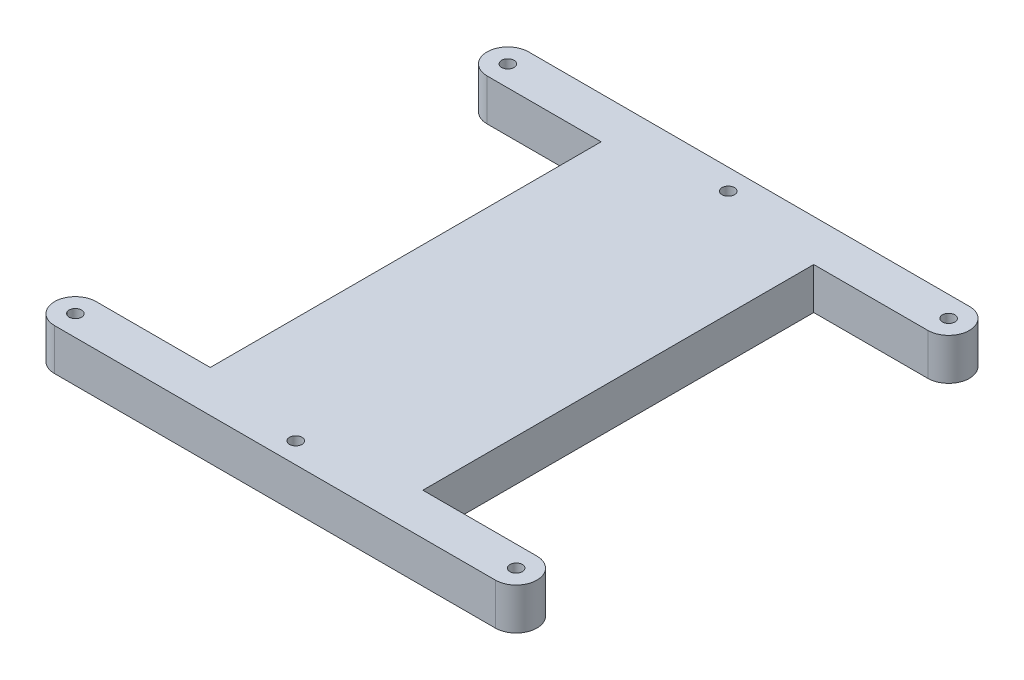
ISO-10303-21;
HEADER;
FILE_DESCRIPTION(('STEP AP214'),'2;1');
FILE_NAME('part.step','',(''),(''),'','','');
FILE_SCHEMA(('AUTOMOTIVE_DESIGN { 1 0 10303 214 1 1 1 1 }'));
ENDSEC;
DATA;
#1=APPLICATION_CONTEXT('core data for automotive mechanical design processes');
#2=APPLICATION_PROTOCOL_DEFINITION('international standard','automotive_design',2000,#1);
#3=PRODUCT_CONTEXT('',#1,'mechanical');
#4=PRODUCT('Part','Part','',(#3));
#5=PRODUCT_RELATED_PRODUCT_CATEGORY('part','',(#4));
#6=PRODUCT_DEFINITION_FORMATION('','',#4);
#7=PRODUCT_DEFINITION_CONTEXT('part definition',#1,'design');
#8=PRODUCT_DEFINITION('design','',#6,#7);
#9=PRODUCT_DEFINITION_SHAPE('','',#8);
#10=(LENGTH_UNIT() NAMED_UNIT(*) SI_UNIT(.MILLI.,.METRE.));
#11=(NAMED_UNIT(*) PLANE_ANGLE_UNIT() SI_UNIT($,.RADIAN.));
#12=(NAMED_UNIT(*) SI_UNIT($,.STERADIAN.) SOLID_ANGLE_UNIT());
#13=UNCERTAINTY_MEASURE_WITH_UNIT(LENGTH_MEASURE(1.E-05),#10,'distance_accuracy_value','');
#14=(GEOMETRIC_REPRESENTATION_CONTEXT(3) GLOBAL_UNCERTAINTY_ASSIGNED_CONTEXT((#13)) GLOBAL_UNIT_ASSIGNED_CONTEXT((#10,
#11,#12)) REPRESENTATION_CONTEXT('',''));
#15=CARTESIAN_POINT('',(0.,0.,0.));
#16=DIRECTION('',(0.,0.,1.));
#17=DIRECTION('',(1.,0.,0.));
#18=AXIS2_PLACEMENT_3D('',#15,#16,#17);
#19=CARTESIAN_POINT('',(530.,-300.,200.));
#20=DIRECTION('',(0.,0.,1.));
#21=DIRECTION('',(1.,0.,0.));
#22=AXIS2_PLACEMENT_3D('',#19,#20,#21);
#23=PLANE('',#22);
#24=DIRECTION('',(0.,-1.,0.));
#25=VECTOR('',#24,1.);
#26=CARTESIAN_POINT('',(-255.608008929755,-300.,200.));
#27=LINE('',#26,#25);
#28=CARTESIAN_POINT('',(-255.608008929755,-200.,200.));
#29=VERTEX_POINT('',#28);
#30=CARTESIAN_POINT('',(-255.608008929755,-300.,200.));
#31=VERTEX_POINT('',#30);
#32=EDGE_CURVE('E238',#29,#31,#27,.T.);
#33=ORIENTED_EDGE('',*,*,#32,.F.);
#34=DIRECTION('',(1.,0.,0.));
#35=VECTOR('',#34,1.);
#36=CARTESIAN_POINT('',(530.,-200.,200.));
#37=LINE('',#36,#35);
#38=CARTESIAN_POINT('',(-530.,-200.,200.));
#39=VERTEX_POINT('',#38);
#40=EDGE_CURVE('E270',#39,#29,#37,.T.);
#41=ORIENTED_EDGE('',*,*,#40,.F.);
#42=DIRECTION('',(0.,1.,0.));
#43=VECTOR('',#42,1.);
#44=CARTESIAN_POINT('',(-530.,-300.,200.));
#45=LINE('',#44,#43);
#46=CARTESIAN_POINT('',(-530.,-300.,200.));
#47=VERTEX_POINT('',#46);
#48=EDGE_CURVE('E295',#47,#39,#45,.T.);
#49=ORIENTED_EDGE('',*,*,#48,.F.);
#50=DIRECTION('',(1.,0.,0.));
#51=VECTOR('',#50,1.);
#52=CARTESIAN_POINT('',(530.,-300.,200.));
#53=LINE('',#52,#51);
#54=EDGE_CURVE('E276',#47,#31,#53,.T.);
#55=ORIENTED_EDGE('',*,*,#54,.T.);
#56=EDGE_LOOP('',(#33,#41,#49,#55));
#57=FACE_BOUND('',#56,.T.);
#58=ADVANCED_FACE('F44',(#57),#23,.T.);
#59=CARTESIAN_POINT('',(530.,-300.,150.));
#60=DIRECTION('',(0.,1.,0.));
#61=DIRECTION('',(0.,0.,1.));
#62=AXIS2_PLACEMENT_3D('',#59,#60,#61);
#63=CYLINDRICAL_SURFACE('',#62,50.);
#64=CARTESIAN_POINT('',(530.,-200.,150.));
#65=DIRECTION('',(0.,1.,0.));
#66=DIRECTION('',(0.,0.,1.));
#67=AXIS2_PLACEMENT_3D('',#64,#65,#66);
#68=CIRCLE('',#67,50.);
#69=CARTESIAN_POINT('',(530.,-200.,200.));
#70=VERTEX_POINT('',#69);
#71=CARTESIAN_POINT('',(530.,-200.,99.9999999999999));
#72=VERTEX_POINT('',#71);
#73=EDGE_CURVE('E261',#70,#72,#68,.T.);
#74=ORIENTED_EDGE('',*,*,#73,.F.);
#75=DIRECTION('',(0.,1.,0.));
#76=VECTOR('',#75,1.);
#77=CARTESIAN_POINT('',(530.,-300.,200.));
#78=LINE('',#77,#76);
#79=CARTESIAN_POINT('',(530.,-300.,200.));
#80=VERTEX_POINT('',#79);
#81=EDGE_CURVE('E53',#80,#70,#78,.T.);
#82=ORIENTED_EDGE('',*,*,#81,.F.);
#83=CARTESIAN_POINT('',(530.,-300.,150.));
#84=DIRECTION('',(0.,1.,0.));
#85=DIRECTION('',(0.,0.,1.));
#86=AXIS2_PLACEMENT_3D('',#83,#84,#85);
#87=CIRCLE('',#86,50.);
#88=CARTESIAN_POINT('',(530.,-300.,99.9999999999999));
#89=VERTEX_POINT('',#88);
#90=EDGE_CURVE('E265',#80,#89,#87,.T.);
#91=ORIENTED_EDGE('',*,*,#90,.T.);
#92=DIRECTION('',(0.,1.,0.));
#93=VECTOR('',#92,1.);
#94=CARTESIAN_POINT('',(530.,-300.,99.9999999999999));
#95=LINE('',#94,#93);
#96=EDGE_CURVE('E105',#89,#72,#95,.T.);
#97=ORIENTED_EDGE('',*,*,#96,.T.);
#98=EDGE_LOOP('',(#74,#82,#91,#97));
#99=FACE_BOUND('',#98,.T.);
#100=ADVANCED_FACE('F46',(#99),#63,.T.);
#101=DIRECTION('',(0.,1.,0.));
#102=VECTOR('',#101,1.);
#103=CARTESIAN_POINT('',(255.608008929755,-300.,200.));
#104=LINE('',#103,#102);
#105=CARTESIAN_POINT('',(255.608008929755,-300.,200.));
#106=VERTEX_POINT('',#105);
#107=CARTESIAN_POINT('',(255.608008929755,-200.,200.));
#108=VERTEX_POINT('',#107);
#109=EDGE_CURVE('E230',#106,#108,#104,.T.);
#110=ORIENTED_EDGE('',*,*,#109,.F.);
#111=EDGE_CURVE('E75',#106,#80,#53,.T.);
#112=ORIENTED_EDGE('',*,*,#111,.T.);
#113=ORIENTED_EDGE('',*,*,#81,.T.);
#114=EDGE_CURVE('E96',#108,#70,#37,.T.);
#115=ORIENTED_EDGE('',*,*,#114,.F.);
#116=EDGE_LOOP('',(#110,#112,#113,#115));
#117=FACE_BOUND('',#116,.T.);
#118=ADVANCED_FACE('F358',(#117),#23,.T.);
#119=CARTESIAN_POINT('',(-530.,-300.,150.));
#120=DIRECTION('',(0.,1.,0.));
#121=DIRECTION('',(0.,0.,1.));
#122=AXIS2_PLACEMENT_3D('',#119,#120,#121);
#123=CYLINDRICAL_SURFACE('',#122,50.);
#124=CARTESIAN_POINT('',(-530.,-200.,150.));
#125=DIRECTION('',(0.,1.,0.));
#126=DIRECTION('',(0.,0.,1.));
#127=AXIS2_PLACEMENT_3D('',#124,#125,#126);
#128=CIRCLE('',#127,50.);
#129=CARTESIAN_POINT('',(-530.,-200.,100.));
#130=VERTEX_POINT('',#129);
#131=EDGE_CURVE('E286',#130,#39,#128,.T.);
#132=ORIENTED_EDGE('',*,*,#131,.F.);
#133=DIRECTION('',(0.,1.,0.));
#134=VECTOR('',#133,1.);
#135=CARTESIAN_POINT('',(-530.,-300.,100.));
#136=LINE('',#135,#134);
#137=CARTESIAN_POINT('',(-530.,-300.,100.));
#138=VERTEX_POINT('',#137);
#139=EDGE_CURVE('E298',#138,#130,#136,.T.);
#140=ORIENTED_EDGE('',*,*,#139,.F.);
#141=CARTESIAN_POINT('',(-530.,-300.,150.));
#142=DIRECTION('',(0.,1.,0.));
#143=DIRECTION('',(0.,0.,1.));
#144=AXIS2_PLACEMENT_3D('',#141,#142,#143);
#145=CIRCLE('',#144,50.);
#146=EDGE_CURVE('E273',#138,#47,#145,.T.);
#147=ORIENTED_EDGE('',*,*,#146,.T.);
#148=ORIENTED_EDGE('',*,*,#48,.T.);
#149=EDGE_LOOP('',(#132,#140,#147,#148));
#150=FACE_BOUND('',#149,.T.);
#151=ADVANCED_FACE('F365',(#150),#123,.T.);
#152=CARTESIAN_POINT('',(530.,-300.,99.9999999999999));
#153=DIRECTION('',(0.,0.,-1.));
#154=DIRECTION('',(-1.,0.,0.));
#155=AXIS2_PLACEMENT_3D('',#152,#153,#154);
#156=PLANE('',#155);
#157=DIRECTION('',(-1.,0.,0.));
#158=VECTOR('',#157,1.);
#159=CARTESIAN_POINT('',(530.,-200.,99.9999999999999));
#160=LINE('',#159,#158);
#161=EDGE_CURVE('E282',#72,#130,#160,.T.);
#162=ORIENTED_EDGE('',*,*,#161,.F.);
#163=ORIENTED_EDGE('',*,*,#96,.F.);
#164=DIRECTION('',(-1.,0.,0.));
#165=VECTOR('',#164,1.);
#166=CARTESIAN_POINT('',(530.,-300.,99.9999999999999));
#167=LINE('',#166,#165);
#168=EDGE_CURVE('E269',#89,#138,#167,.T.);
#169=ORIENTED_EDGE('',*,*,#168,.T.);
#170=ORIENTED_EDGE('',*,*,#139,.T.);
#171=EDGE_LOOP('',(#162,#163,#169,#170));
#172=FACE_BOUND('',#171,.T.);
#173=ADVANCED_FACE('F303',(#172),#156,.T.);
#174=CARTESIAN_POINT('',(530.,-300.,150.));
#175=DIRECTION('',(0.,1.,0.));
#176=DIRECTION('',(0.,0.,1.));
#177=AXIS2_PLACEMENT_3D('',#174,#175,#176);
#178=PLANE('',#177);
#179=DIRECTION('',(0.,0.,-1.));
#180=VECTOR('',#179,1.);
#181=CARTESIAN_POINT('',(255.608008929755,-300.,1153.65160130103));
#182=LINE('',#181,#180);
#183=CARTESIAN_POINT('',(255.608008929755,-300.,1140.));
#184=VERTEX_POINT('',#183);
#185=EDGE_CURVE('E181',#184,#106,#182,.T.);
#186=ORIENTED_EDGE('',*,*,#185,.F.);
#187=DIRECTION('',(-1.,0.,0.));
#188=VECTOR('',#187,1.);
#189=CARTESIAN_POINT('',(530.,-300.,1140.));
#190=LINE('',#189,#188);
#191=CARTESIAN_POINT('',(530.,-300.,1140.));
#192=VERTEX_POINT('',#191);
#193=EDGE_CURVE('E162',#192,#184,#190,.T.);
#194=ORIENTED_EDGE('',*,*,#193,.F.);
#195=CARTESIAN_POINT('',(530.,-300.,1190.));
#196=DIRECTION('',(0.,1.,0.));
#197=DIRECTION('',(0.,0.,-1.));
#198=AXIS2_PLACEMENT_3D('',#195,#196,#197);
#199=CIRCLE('',#198,50.);
#200=CARTESIAN_POINT('',(530.,-300.,1240.));
#201=VERTEX_POINT('',#200);
#202=EDGE_CURVE('E179',#201,#192,#199,.T.);
#203=ORIENTED_EDGE('',*,*,#202,.F.);
#204=DIRECTION('',(1.,0.,0.));
#205=VECTOR('',#204,1.);
#206=CARTESIAN_POINT('',(530.,-300.,1240.));
#207=LINE('',#206,#205);
#208=CARTESIAN_POINT('',(-530.,-300.,1240.));
#209=VERTEX_POINT('',#208);
#210=EDGE_CURVE('E171',#209,#201,#207,.T.);
#211=ORIENTED_EDGE('',*,*,#210,.F.);
#212=CARTESIAN_POINT('',(-530.,-300.,1190.));
#213=DIRECTION('',(0.,1.,0.));
#214=DIRECTION('',(0.,0.,-1.));
#215=AXIS2_PLACEMENT_3D('',#212,#213,#214);
#216=CIRCLE('',#215,49.9999999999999);
#217=CARTESIAN_POINT('',(-530.,-300.,1140.));
#218=VERTEX_POINT('',#217);
#219=EDGE_CURVE('E183',#218,#209,#216,.T.);
#220=ORIENTED_EDGE('',*,*,#219,.F.);
#221=CARTESIAN_POINT('',(-255.608008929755,-300.,1140.));
#222=VERTEX_POINT('',#221);
#223=EDGE_CURVE('E184',#222,#218,#190,.T.);
#224=ORIENTED_EDGE('',*,*,#223,.F.);
#225=DIRECTION('',(0.,0.,1.));
#226=VECTOR('',#225,1.);
#227=CARTESIAN_POINT('',(-255.608008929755,-300.,1153.65160130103));
#228=LINE('',#227,#226);
#229=EDGE_CURVE('E224',#31,#222,#228,.T.);
#230=ORIENTED_EDGE('',*,*,#229,.F.);
#231=ORIENTED_EDGE('',*,*,#54,.F.);
#232=ORIENTED_EDGE('',*,*,#146,.F.);
#233=ORIENTED_EDGE('',*,*,#168,.F.);
#234=ORIENTED_EDGE('',*,*,#90,.F.);
#235=ORIENTED_EDGE('',*,*,#111,.F.);
#236=EDGE_LOOP('',(#186,#194,#203,#211,#220,#224,#230,#231,#232,#233,#234,#235));
#237=FACE_BOUND('',#236,.T.);
#238=CARTESIAN_POINT('',(0.,-300.,150.));
#239=DIRECTION('',(0.,1.,0.));
#240=DIRECTION('',(0.,0.,1.));
#241=AXIS2_PLACEMENT_3D('',#238,#239,#240);
#242=CIRCLE('',#241,15.);
#243=CARTESIAN_POINT('',(0.,-300.,165.));
#244=VERTEX_POINT('',#243);
#245=EDGE_CURVE('E242',#244,#244,#242,.T.);
#246=ORIENTED_EDGE('',*,*,#245,.T.);
#247=EDGE_LOOP('',(#246));
#248=FACE_BOUND('',#247,.T.);
#249=CARTESIAN_POINT('',(-530.,-300.,150.));
#250=DIRECTION('',(0.,1.,0.));
#251=DIRECTION('',(0.,0.,1.));
#252=AXIS2_PLACEMENT_3D('',#249,#250,#251);
#253=CIRCLE('',#252,15.);
#254=CARTESIAN_POINT('',(-530.,-300.,165.));
#255=VERTEX_POINT('',#254);
#256=EDGE_CURVE('E250',#255,#255,#253,.T.);
#257=ORIENTED_EDGE('',*,*,#256,.T.);
#258=EDGE_LOOP('',(#257));
#259=FACE_BOUND('',#258,.T.);
#260=CARTESIAN_POINT('',(530.,-300.,150.));
#261=DIRECTION('',(0.,1.,0.));
#262=DIRECTION('',(0.,0.,1.));
#263=AXIS2_PLACEMENT_3D('',#260,#261,#262);
#264=CIRCLE('',#263,15.);
#265=CARTESIAN_POINT('',(530.,-300.,165.));
#266=VERTEX_POINT('',#265);
#267=EDGE_CURVE('E257',#266,#266,#264,.T.);
#268=ORIENTED_EDGE('',*,*,#267,.T.);
#269=EDGE_LOOP('',(#268));
#270=FACE_BOUND('',#269,.T.);
#271=CARTESIAN_POINT('',(0.,-300.,1190.));
#272=DIRECTION('',(0.,1.,0.));
#273=DIRECTION('',(0.,0.,1.));
#274=AXIS2_PLACEMENT_3D('',#271,#272,#273);
#275=CIRCLE('',#274,15.);
#276=CARTESIAN_POINT('',(0.,-300.,1205.));
#277=VERTEX_POINT('',#276);
#278=EDGE_CURVE('E335',#277,#277,#275,.T.);
#279=ORIENTED_EDGE('',*,*,#278,.T.);
#280=EDGE_LOOP('',(#279));
#281=FACE_BOUND('',#280,.T.);
#282=CARTESIAN_POINT('',(530.,-300.,1190.));
#283=DIRECTION('',(0.,1.,0.));
#284=DIRECTION('',(0.,0.,-1.));
#285=AXIS2_PLACEMENT_3D('',#282,#283,#284);
#286=CIRCLE('',#285,15.);
#287=CARTESIAN_POINT('',(530.,-300.,1175.));
#288=VERTEX_POINT('',#287);
#289=EDGE_CURVE('E327',#288,#288,#286,.T.);
#290=ORIENTED_EDGE('',*,*,#289,.T.);
#291=EDGE_LOOP('',(#290));
#292=FACE_BOUND('',#291,.T.);
#293=CARTESIAN_POINT('',(-530.,-300.,1190.));
#294=DIRECTION('',(0.,1.,0.));
#295=DIRECTION('',(0.,0.,-1.));
#296=AXIS2_PLACEMENT_3D('',#293,#294,#295);
#297=CIRCLE('',#296,15.);
#298=CARTESIAN_POINT('',(-530.,-300.,1175.));
#299=VERTEX_POINT('',#298);
#300=EDGE_CURVE('E209',#299,#299,#297,.T.);
#301=ORIENTED_EDGE('',*,*,#300,.T.);
#302=EDGE_LOOP('',(#301));
#303=FACE_BOUND('',#302,.T.);
#304=ADVANCED_FACE('F176',(#237,#248,#259,#270,#281,#292,#303),#178,.F.);
#305=CARTESIAN_POINT('',(530.,-200.,150.));
#306=DIRECTION('',(0.,1.,0.));
#307=DIRECTION('',(0.,0.,1.));
#308=AXIS2_PLACEMENT_3D('',#305,#306,#307);
#309=PLANE('',#308);
#310=DIRECTION('',(0.,0.,1.));
#311=VECTOR('',#310,1.);
#312=CARTESIAN_POINT('',(-255.608008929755,-200.,1153.65160130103));
#313=LINE('',#312,#311);
#314=CARTESIAN_POINT('',(-255.608008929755,-200.,1140.));
#315=VERTEX_POINT('',#314);
#316=EDGE_CURVE('E223',#29,#315,#313,.T.);
#317=ORIENTED_EDGE('',*,*,#316,.T.);
#318=DIRECTION('',(-1.,0.,0.));
#319=VECTOR('',#318,1.);
#320=CARTESIAN_POINT('',(530.,-200.,1140.));
#321=LINE('',#320,#319);
#322=CARTESIAN_POINT('',(-530.,-200.,1140.));
#323=VERTEX_POINT('',#322);
#324=EDGE_CURVE('E208',#315,#323,#321,.T.);
#325=ORIENTED_EDGE('',*,*,#324,.T.);
#326=CARTESIAN_POINT('',(-530.,-200.,1190.));
#327=DIRECTION('',(0.,1.,0.));
#328=DIRECTION('',(0.,0.,-1.));
#329=AXIS2_PLACEMENT_3D('',#326,#327,#328);
#330=CIRCLE('',#329,49.9999999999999);
#331=CARTESIAN_POINT('',(-530.,-200.,1240.));
#332=VERTEX_POINT('',#331);
#333=EDGE_CURVE('E194',#323,#332,#330,.T.);
#334=ORIENTED_EDGE('',*,*,#333,.T.);
#335=DIRECTION('',(1.,0.,0.));
#336=VECTOR('',#335,1.);
#337=CARTESIAN_POINT('',(530.,-200.,1240.));
#338=LINE('',#337,#336);
#339=CARTESIAN_POINT('',(530.,-200.,1240.));
#340=VERTEX_POINT('',#339);
#341=EDGE_CURVE('E189',#332,#340,#338,.T.);
#342=ORIENTED_EDGE('',*,*,#341,.T.);
#343=CARTESIAN_POINT('',(530.,-200.,1190.));
#344=DIRECTION('',(0.,1.,0.));
#345=DIRECTION('',(0.,0.,-1.));
#346=AXIS2_PLACEMENT_3D('',#343,#344,#345);
#347=CIRCLE('',#346,50.);
#348=CARTESIAN_POINT('',(530.,-200.,1140.));
#349=VERTEX_POINT('',#348);
#350=EDGE_CURVE('E205',#340,#349,#347,.T.);
#351=ORIENTED_EDGE('',*,*,#350,.T.);
#352=CARTESIAN_POINT('',(255.608008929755,-200.,1140.));
#353=VERTEX_POINT('',#352);
#354=EDGE_CURVE('E164',#349,#353,#321,.T.);
#355=ORIENTED_EDGE('',*,*,#354,.T.);
#356=DIRECTION('',(0.,0.,-1.));
#357=VECTOR('',#356,1.);
#358=CARTESIAN_POINT('',(255.608008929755,-200.,1153.65160130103));
#359=LINE('',#358,#357);
#360=EDGE_CURVE('E63',#353,#108,#359,.T.);
#361=ORIENTED_EDGE('',*,*,#360,.T.);
#362=ORIENTED_EDGE('',*,*,#114,.T.);
#363=ORIENTED_EDGE('',*,*,#73,.T.);
#364=ORIENTED_EDGE('',*,*,#161,.T.);
#365=ORIENTED_EDGE('',*,*,#131,.T.);
#366=ORIENTED_EDGE('',*,*,#40,.T.);
#367=EDGE_LOOP('',(#317,#325,#334,#342,#351,#355,#361,#362,#363,#364,#365,#366));
#368=FACE_BOUND('',#367,.T.);
#369=CARTESIAN_POINT('',(0.,-200.,150.));
#370=DIRECTION('',(0.,1.,0.));
#371=DIRECTION('',(0.,0.,1.));
#372=AXIS2_PLACEMENT_3D('',#369,#370,#371);
#373=CIRCLE('',#372,15.);
#374=CARTESIAN_POINT('',(0.,-200.,165.));
#375=VERTEX_POINT('',#374);
#376=EDGE_CURVE('E241',#375,#375,#373,.T.);
#377=ORIENTED_EDGE('',*,*,#376,.F.);
#378=EDGE_LOOP('',(#377));
#379=FACE_BOUND('',#378,.T.);
#380=CARTESIAN_POINT('',(-530.,-200.,150.));
#381=DIRECTION('',(0.,1.,0.));
#382=DIRECTION('',(0.,0.,1.));
#383=AXIS2_PLACEMENT_3D('',#380,#381,#382);
#384=CIRCLE('',#383,15.);
#385=CARTESIAN_POINT('',(-530.,-200.,165.));
#386=VERTEX_POINT('',#385);
#387=EDGE_CURVE('E246',#386,#386,#384,.T.);
#388=ORIENTED_EDGE('',*,*,#387,.F.);
#389=EDGE_LOOP('',(#388));
#390=FACE_BOUND('',#389,.T.);
#391=CARTESIAN_POINT('',(530.,-200.,150.));
#392=DIRECTION('',(0.,1.,0.));
#393=DIRECTION('',(0.,0.,1.));
#394=AXIS2_PLACEMENT_3D('',#391,#392,#393);
#395=CIRCLE('',#394,15.);
#396=CARTESIAN_POINT('',(530.,-200.,165.));
#397=VERTEX_POINT('',#396);
#398=EDGE_CURVE('E253',#397,#397,#395,.T.);
#399=ORIENTED_EDGE('',*,*,#398,.F.);
#400=EDGE_LOOP('',(#399));
#401=FACE_BOUND('',#400,.T.);
#402=CARTESIAN_POINT('',(0.,-200.,1190.));
#403=DIRECTION('',(0.,1.,0.));
#404=DIRECTION('',(0.,0.,1.));
#405=AXIS2_PLACEMENT_3D('',#402,#403,#404);
#406=CIRCLE('',#405,15.);
#407=CARTESIAN_POINT('',(0.,-200.,1205.));
#408=VERTEX_POINT('',#407);
#409=EDGE_CURVE('E319',#408,#408,#406,.T.);
#410=ORIENTED_EDGE('',*,*,#409,.F.);
#411=EDGE_LOOP('',(#410));
#412=FACE_BOUND('',#411,.T.);
#413=CARTESIAN_POINT('',(530.,-200.,1190.));
#414=DIRECTION('',(0.,1.,0.));
#415=DIRECTION('',(0.,0.,-1.));
#416=AXIS2_PLACEMENT_3D('',#413,#414,#415);
#417=CIRCLE('',#416,15.);
#418=CARTESIAN_POINT('',(530.,-200.,1175.));
#419=VERTEX_POINT('',#418);
#420=EDGE_CURVE('E323',#419,#419,#417,.T.);
#421=ORIENTED_EDGE('',*,*,#420,.F.);
#422=EDGE_LOOP('',(#421));
#423=FACE_BOUND('',#422,.T.);
#424=CARTESIAN_POINT('',(-530.,-200.,1190.));
#425=DIRECTION('',(0.,1.,0.));
#426=DIRECTION('',(0.,0.,-1.));
#427=AXIS2_PLACEMENT_3D('',#424,#425,#426);
#428=CIRCLE('',#427,15.);
#429=CARTESIAN_POINT('',(-530.,-200.,1175.));
#430=VERTEX_POINT('',#429);
#431=EDGE_CURVE('E197',#430,#430,#428,.T.);
#432=ORIENTED_EDGE('',*,*,#431,.F.);
#433=EDGE_LOOP('',(#432));
#434=FACE_BOUND('',#433,.T.);
#435=ADVANCED_FACE('F305',(#368,#379,#390,#401,#412,#423,#434),#309,.T.);
#436=CARTESIAN_POINT('',(530.,-300.,150.));
#437=DIRECTION('',(0.,1.,0.));
#438=DIRECTION('',(0.,0.,1.));
#439=AXIS2_PLACEMENT_3D('',#436,#437,#438);
#440=CYLINDRICAL_SURFACE('',#439,15.);
#441=ORIENTED_EDGE('',*,*,#267,.F.);
#442=EDGE_LOOP('',(#441));
#443=FACE_BOUND('',#442,.T.);
#444=ORIENTED_EDGE('',*,*,#398,.T.);
#445=EDGE_LOOP('',(#444));
#446=FACE_BOUND('',#445,.T.);
#447=ADVANCED_FACE('F308',(#443,#446),#440,.F.);
#448=CARTESIAN_POINT('',(-530.,-300.,150.));
#449=DIRECTION('',(0.,1.,0.));
#450=DIRECTION('',(0.,0.,1.));
#451=AXIS2_PLACEMENT_3D('',#448,#449,#450);
#452=CYLINDRICAL_SURFACE('',#451,15.);
#453=ORIENTED_EDGE('',*,*,#256,.F.);
#454=EDGE_LOOP('',(#453));
#455=FACE_BOUND('',#454,.T.);
#456=ORIENTED_EDGE('',*,*,#387,.T.);
#457=EDGE_LOOP('',(#456));
#458=FACE_BOUND('',#457,.T.);
#459=ADVANCED_FACE('F405',(#455,#458),#452,.F.);
#460=CARTESIAN_POINT('',(0.,-300.,150.));
#461=DIRECTION('',(0.,1.,0.));
#462=DIRECTION('',(0.,0.,1.));
#463=AXIS2_PLACEMENT_3D('',#460,#461,#462);
#464=CYLINDRICAL_SURFACE('',#463,15.);
#465=ORIENTED_EDGE('',*,*,#245,.F.);
#466=EDGE_LOOP('',(#465));
#467=FACE_BOUND('',#466,.T.);
#468=ORIENTED_EDGE('',*,*,#376,.T.);
#469=EDGE_LOOP('',(#468));
#470=FACE_BOUND('',#469,.T.);
#471=ADVANCED_FACE('F399',(#467,#470),#464,.F.);
#472=CARTESIAN_POINT('',(-255.608008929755,-300.,1153.65160130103));
#473=DIRECTION('',(-1.,0.,0.));
#474=DIRECTION('',(0.,0.,1.));
#475=AXIS2_PLACEMENT_3D('',#472,#473,#474);
#476=PLANE('',#475);
#477=DIRECTION('',(0.,-1.,0.));
#478=VECTOR('',#477,1.);
#479=CARTESIAN_POINT('',(-255.608008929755,-300.,1140.));
#480=LINE('',#479,#478);
#481=EDGE_CURVE('E216',#315,#222,#480,.T.);
#482=ORIENTED_EDGE('',*,*,#481,.F.);
#483=ORIENTED_EDGE('',*,*,#316,.F.);
#484=ORIENTED_EDGE('',*,*,#32,.T.);
#485=ORIENTED_EDGE('',*,*,#229,.T.);
#486=EDGE_LOOP('',(#482,#483,#484,#485));
#487=FACE_BOUND('',#486,.T.);
#488=ADVANCED_FACE('F379',(#487),#476,.T.);
#489=CARTESIAN_POINT('',(255.608008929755,-300.,1153.65160130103));
#490=DIRECTION('',(1.,0.,0.));
#491=DIRECTION('',(0.,0.,-1.));
#492=AXIS2_PLACEMENT_3D('',#489,#490,#491);
#493=PLANE('',#492);
#494=DIRECTION('',(0.,1.,0.));
#495=VECTOR('',#494,1.);
#496=CARTESIAN_POINT('',(255.608008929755,-300.,1140.));
#497=LINE('',#496,#495);
#498=EDGE_CURVE('E11',#184,#353,#497,.T.);
#499=ORIENTED_EDGE('',*,*,#498,.F.);
#500=ORIENTED_EDGE('',*,*,#185,.T.);
#501=ORIENTED_EDGE('',*,*,#109,.T.);
#502=ORIENTED_EDGE('',*,*,#360,.F.);
#503=EDGE_LOOP('',(#499,#500,#501,#502));
#504=FACE_BOUND('',#503,.T.);
#505=ADVANCED_FACE('F391',(#504),#493,.T.);
#506=CARTESIAN_POINT('',(530.,-300.,1140.));
#507=DIRECTION('',(0.,0.,-1.));
#508=DIRECTION('',(-1.,0.,0.));
#509=AXIS2_PLACEMENT_3D('',#506,#507,#508);
#510=PLANE('',#509);
#511=ORIENTED_EDGE('',*,*,#324,.F.);
#512=ORIENTED_EDGE('',*,*,#481,.T.);
#513=ORIENTED_EDGE('',*,*,#223,.T.);
#514=DIRECTION('',(0.,1.,0.));
#515=VECTOR('',#514,1.);
#516=CARTESIAN_POINT('',(-530.,-300.,1140.));
#517=LINE('',#516,#515);
#518=EDGE_CURVE('E170',#218,#323,#517,.T.);
#519=ORIENTED_EDGE('',*,*,#518,.T.);
#520=EDGE_LOOP('',(#511,#512,#513,#519));
#521=FACE_BOUND('',#520,.T.);
#522=ADVANCED_FACE('F384',(#521),#510,.T.);
#523=CARTESIAN_POINT('',(530.,-300.,1190.));
#524=DIRECTION('',(0.,1.,0.));
#525=DIRECTION('',(0.,0.,1.));
#526=AXIS2_PLACEMENT_3D('',#523,#524,#525);
#527=CYLINDRICAL_SURFACE('',#526,50.);
#528=ORIENTED_EDGE('',*,*,#350,.F.);
#529=DIRECTION('',(0.,1.,0.));
#530=VECTOR('',#529,1.);
#531=CARTESIAN_POINT('',(530.,-300.,1240.));
#532=LINE('',#531,#530);
#533=EDGE_CURVE('E187',#201,#340,#532,.T.);
#534=ORIENTED_EDGE('',*,*,#533,.F.);
#535=ORIENTED_EDGE('',*,*,#202,.T.);
#536=DIRECTION('',(0.,1.,0.));
#537=VECTOR('',#536,1.);
#538=CARTESIAN_POINT('',(530.,-300.,1140.));
#539=LINE('',#538,#537);
#540=EDGE_CURVE('E159',#192,#349,#539,.T.);
#541=ORIENTED_EDGE('',*,*,#540,.T.);
#542=EDGE_LOOP('',(#528,#534,#535,#541));
#543=FACE_BOUND('',#542,.T.);
#544=ADVANCED_FACE('F186',(#543),#527,.T.);
#545=CARTESIAN_POINT('',(530.,-300.,1240.));
#546=DIRECTION('',(0.,0.,1.));
#547=DIRECTION('',(1.,0.,0.));
#548=AXIS2_PLACEMENT_3D('',#545,#546,#547);
#549=PLANE('',#548);
#550=ORIENTED_EDGE('',*,*,#341,.F.);
#551=DIRECTION('',(0.,1.,0.));
#552=VECTOR('',#551,1.);
#553=CARTESIAN_POINT('',(-530.,-300.,1240.));
#554=LINE('',#553,#552);
#555=EDGE_CURVE('E217',#209,#332,#554,.T.);
#556=ORIENTED_EDGE('',*,*,#555,.F.);
#557=ORIENTED_EDGE('',*,*,#210,.T.);
#558=ORIENTED_EDGE('',*,*,#533,.T.);
#559=EDGE_LOOP('',(#550,#556,#557,#558));
#560=FACE_BOUND('',#559,.T.);
#561=ADVANCED_FACE('F390',(#560),#549,.T.);
#562=CARTESIAN_POINT('',(-530.,-300.,1190.));
#563=DIRECTION('',(0.,1.,0.));
#564=DIRECTION('',(0.,0.,1.));
#565=AXIS2_PLACEMENT_3D('',#562,#563,#564);
#566=CYLINDRICAL_SURFACE('',#565,49.9999999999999);
#567=ORIENTED_EDGE('',*,*,#333,.F.);
#568=ORIENTED_EDGE('',*,*,#518,.F.);
#569=ORIENTED_EDGE('',*,*,#219,.T.);
#570=ORIENTED_EDGE('',*,*,#555,.T.);
#571=EDGE_LOOP('',(#567,#568,#569,#570));
#572=FACE_BOUND('',#571,.T.);
#573=ADVANCED_FACE('F387',(#572),#566,.T.);
#574=ORIENTED_EDGE('',*,*,#193,.T.);
#575=ORIENTED_EDGE('',*,*,#498,.T.);
#576=ORIENTED_EDGE('',*,*,#354,.F.);
#577=ORIENTED_EDGE('',*,*,#540,.F.);
#578=EDGE_LOOP('',(#574,#575,#576,#577));
#579=FACE_BOUND('',#578,.T.);
#580=ADVANCED_FACE('F161',(#579),#510,.T.);
#581=CARTESIAN_POINT('',(-530.,-300.,1190.));
#582=DIRECTION('',(0.,1.,0.));
#583=DIRECTION('',(0.,0.,1.));
#584=AXIS2_PLACEMENT_3D('',#581,#582,#583);
#585=CYLINDRICAL_SURFACE('',#584,15.);
#586=ORIENTED_EDGE('',*,*,#300,.F.);
#587=EDGE_LOOP('',(#586));
#588=FACE_BOUND('',#587,.T.);
#589=ORIENTED_EDGE('',*,*,#431,.T.);
#590=EDGE_LOOP('',(#589));
#591=FACE_BOUND('',#590,.T.);
#592=ADVANCED_FACE('F352',(#588,#591),#585,.F.);
#593=CARTESIAN_POINT('',(530.,-300.,1190.));
#594=DIRECTION('',(0.,1.,0.));
#595=DIRECTION('',(0.,0.,1.));
#596=AXIS2_PLACEMENT_3D('',#593,#594,#595);
#597=CYLINDRICAL_SURFACE('',#596,15.);
#598=ORIENTED_EDGE('',*,*,#289,.F.);
#599=EDGE_LOOP('',(#598));
#600=FACE_BOUND('',#599,.T.);
#601=ORIENTED_EDGE('',*,*,#420,.T.);
#602=EDGE_LOOP('',(#601));
#603=FACE_BOUND('',#602,.T.);
#604=ADVANCED_FACE('F347',(#600,#603),#597,.F.);
#605=CARTESIAN_POINT('',(0.,-300.,1190.));
#606=DIRECTION('',(0.,1.,0.));
#607=DIRECTION('',(0.,0.,1.));
#608=AXIS2_PLACEMENT_3D('',#605,#606,#607);
#609=CYLINDRICAL_SURFACE('',#608,15.);
#610=ORIENTED_EDGE('',*,*,#278,.F.);
#611=EDGE_LOOP('',(#610));
#612=FACE_BOUND('',#611,.T.);
#613=ORIENTED_EDGE('',*,*,#409,.T.);
#614=EDGE_LOOP('',(#613));
#615=FACE_BOUND('',#614,.T.);
#616=ADVANCED_FACE('F344',(#612,#615),#609,.F.);
#617=CLOSED_SHELL('',(#58,#100,#118,#151,#173,#304,#435,#447,#459,#471,#488,#505,#522,#544,#561,
#573,#580,#592,#604,#616));
#618=MANIFOLD_SOLID_BREP('B2',#617);
#619=ADVANCED_BREP_SHAPE_REPRESENTATION('',(#18,#618),#14);
#620=SHAPE_DEFINITION_REPRESENTATION(#9,#619);
ENDSEC;
END-ISO-10303-21;
